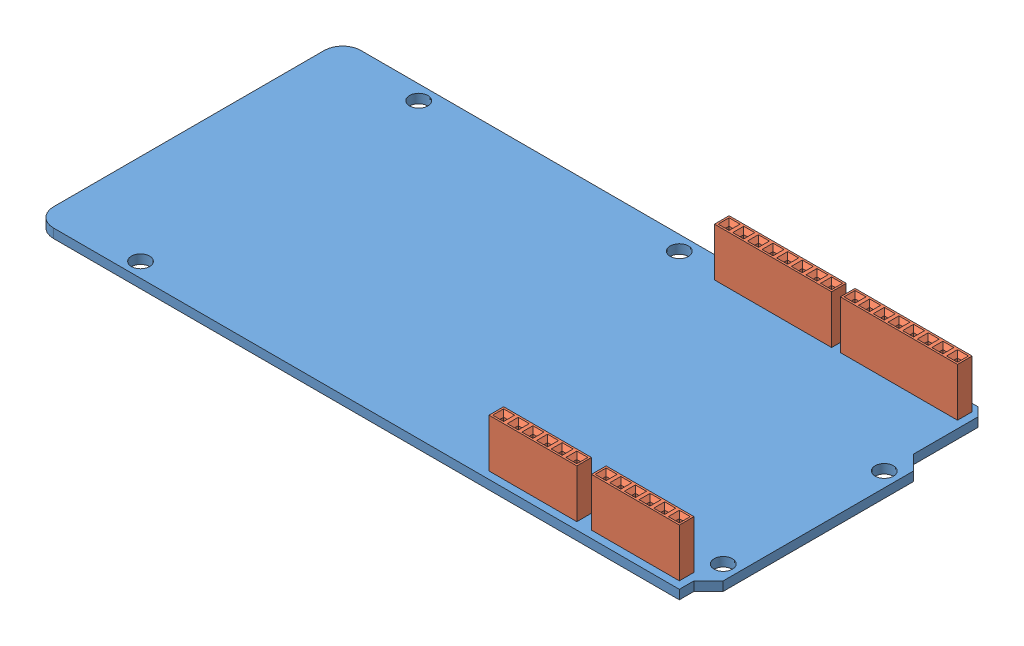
SolidWorks assembly RASCAL.SLDASM, configuration Default (file format 4400). Lengths in mm.
Overall size (114.3 9.97 53.34).
6 component instances, 2 part files, 3 mates.
Components (placement in the parent):
- PCB-1: PCB.SLDPRT [Default] at (-56.4315 9.8429 19.2589) size (114.3 1.59 53.34)
- SHIELD CONNECTORS-3: SHIELD CONNECTORS.SLDASM [Default] at (79.5356 -10.8439 18.5745) size (42.16 8.38 50.8)
  - HEADER, FEMALE-1: HEADER, FEMALE.SLDPRT [6-pin] at (-26.747 22.2743 -1.8556) size (15.24 8.38 2.54)
  - HEADER, FEMALE-2: HEADER, FEMALE.SLDPRT [6-pin] at (-44.527 22.2743 -1.8556) size (15.24 8.38 2.54)
  - HEADER, FEMALE-3: HEADER, FEMALE.SLDPRT [8-pin] at (-48.591 22.2743 -50.1156) size (20.32 8.38 2.54)
  - HEADER, FEMALE-4: HEADER, FEMALE.SLDPRT [8-pin] at (-26.747 22.2743 -50.1156) size (20.32 8.38 2.54)
Mates (geometry in assembly coordinates):
- Coincident1: coincident anti-aligned: plane of PCB-1 through (-53.2565 11.4304 16.0839) normal (0 1 0); plane of SHIELD CONNECTORS-3/HEADER, FEMALE-1 through (51.5185 11.4304 15.4489) normal (0 -1 0)
- Distance1: distance = 1.27 mm aligned: plane of SHIELD CONNECTORS-3/HEADER, FEMALE-1 through (54.0585 19.8124 17.9889) normal (1 0 0); plane of PCB-1 through (55.3285 11.4304 19.2589) normal (1 0 0)
- Distance2: distance = 1.27 mm aligned: plane of SHIELD CONNECTORS-3/HEADER, FEMALE-1 through (51.5185 19.8124 17.9889) normal (0 0 1); plane of PCB-1 through (-53.2565 11.4304 19.2589) normal (0 0 1)
